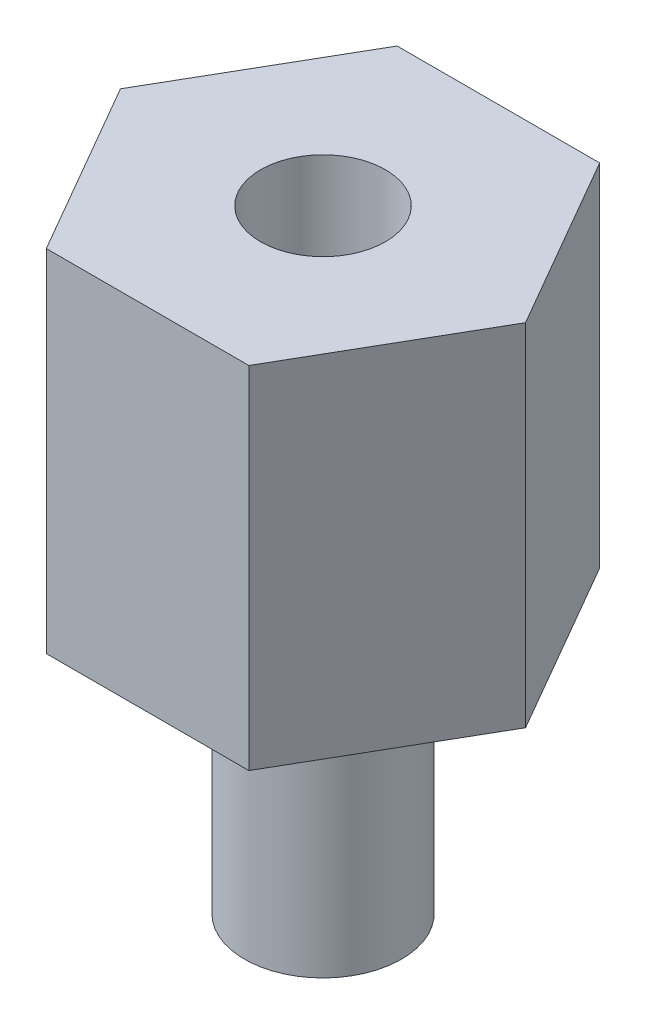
from build123d import *

# Parameters (mm, degrees)
BASE_EXTRUDE_DEPTH        = 6.35
SKETCH2_R                 = 1.4224
EXTRUDE1_DEPTH            = 4.7498
F_4_40_TAPPED_HOLE1_D     = 2.2606
F_4_40_TAPPED_HOLE1_DEPTH = 8.8646
F_4_40_TAPPED_HOLE1_TIP   = 0.679152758


with BuildPart() as part:
    # Sketch1 → Base-Extrude (new body)
    with BuildSketch(Plane(origin=(0, 0, 0), x_dir=(1, 0, 0), z_dir=(0, 1, 0))):
        Polygon((3.666174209, 0), (1.833087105, 3.175), (-1.833087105, 3.175), (-3.666174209, 0), (-1.833087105, -3.175), (1.833087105, -3.175), align=None)
    extrude(amount=BASE_EXTRUDE_DEPTH)

    # Sketch2 → Extrude1 (add)
    with BuildSketch(Plane.XZ):
        with Locations(Location((0, 0, 0), (0, 0, 270))):
            Circle(SKETCH2_R)
    extrude(amount=EXTRUDE1_DEPTH)

    # 4-40 Tapped Hole1
    with Locations(Plane(origin=(0, 6.35, 0), x_dir=(-1, 0, 0), z_dir=(0, 1, 0))):
        with Locations((0, 0)):
            Hole(F_4_40_TAPPED_HOLE1_D / 2, depth=F_4_40_TAPPED_HOLE1_DEPTH)
            with Locations((0, 0, -(F_4_40_TAPPED_HOLE1_DEPTH + F_4_40_TAPPED_HOLE1_TIP / 2))):  # 118° drill point
                Cone(0, F_4_40_TAPPED_HOLE1_D / 2, F_4_40_TAPPED_HOLE1_TIP, mode=Mode.SUBTRACT)


solid = part.part
